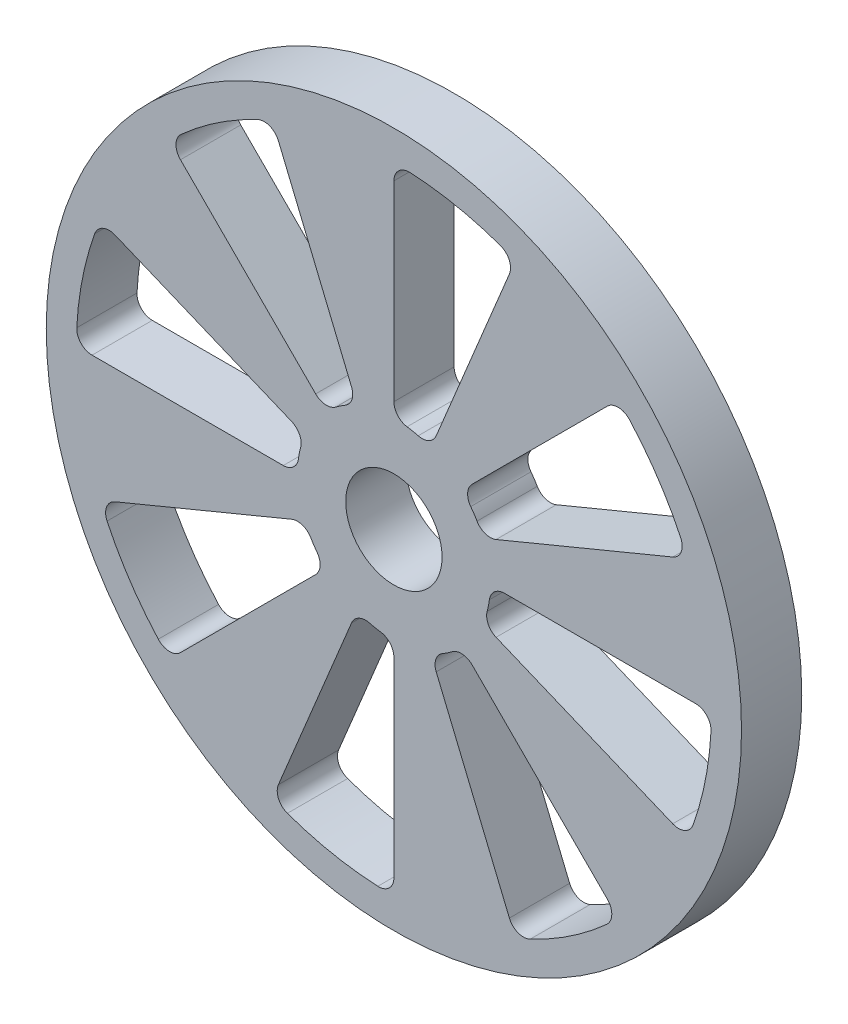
from build123d import *

# Parameters (mm, degrees)
SKETCH1_R           = 28.855
SKETCH1_R_2         = 26.355
SKETCH1_R_3         = 8
SKETCH1_R_4         = 4
BOSS_EXTRUDE1_DEPTH = 5
FILLET2_R           = 1.27


with BuildPart() as part:
    # Sketch1 → Boss-Extrude1 (new body)
    # profile 1 of 10: a face of its own
    with BuildSketch(Plane.XY):
        Circle(SKETCH1_R)
        Circle(SKETCH1_R_2, mode=Mode.SUBTRACT)
    # profile 2 of 10: a face of its own
    with BuildSketch(Plane.XY):
        with BuildLine():
            ThreePointArc((-3.061467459, 7.39103626), (-1.560722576, 7.846282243), (0, 8))
            Line((0, 8), (0, 26.355))
            ThreePointArc((0, 26.355), (-5.141605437, 25.848596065), (-10.08562186, 24.348845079))
            Line((-10.08562186, 24.348845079), (-3.061467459, 7.39103626))
        make_face()
    # profile 3 of 10: a face of its own
    with BuildSketch(Plane.XY):
        with BuildLine():
            Line((10.08562186, 24.348845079), (3.061467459, 7.39103626))
            ThreePointArc((3.061467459, 7.39103626), (4.444561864, 6.651756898), (5.656854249, 5.656854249))
            Line((5.656854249, 5.656854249), (18.635799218, 18.635799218))
            ThreePointArc((18.635799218, 18.635799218), (14.642053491, 21.913381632), (10.08562186, 24.348845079))
        make_face()
    # profile 4 of 10: a face of its own
    with BuildSketch(Plane.XY):
        with BuildLine():
            Line((24.348845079, 10.08562186), (7.39103626, 3.061467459))
            ThreePointArc((7.39103626, 3.061467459), (7.846282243, 1.560722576), (8, 0))
            Line((8, 0), (26.355, 0))
            ThreePointArc((26.355, 0), (25.848596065, 5.141605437), (24.348845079, 10.08562186))
        make_face()
    # profile 5 of 10: a face of its own
    with BuildSketch(Plane.XY):
        with BuildLine():
            Line((24.348845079, -10.08562186), (7.39103626, -3.061467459))
            ThreePointArc((7.39103626, -3.061467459), (6.651756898, -4.444561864), (5.656854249, -5.656854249))
            Line((5.656854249, -5.656854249), (18.635799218, -18.635799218))
            ThreePointArc((18.635799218, -18.635799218), (21.913381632, -14.642053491), (24.348845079, -10.08562186))
        make_face()
    # profile 6 of 10: a face of its own
    with BuildSketch(Plane.XY):
        with BuildLine():
            Line((10.08562186, -24.348845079), (3.061467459, -7.39103626))
            ThreePointArc((3.061467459, -7.39103626), (1.560722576, -7.846282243), (0, -8))
            Line((0, -8), (0, -26.355))
            ThreePointArc((0, -26.355), (5.141605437, -25.848596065), (10.08562186, -24.348845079))
        make_face()
    # profile 7 of 10: a face of its own
    with BuildSketch(Plane.XY):
        with BuildLine():
            ThreePointArc((-3.061467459, -7.39103626), (-4.444561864, -6.651756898), (-5.656854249, -5.656854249))
            Line((-5.656854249, -5.656854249), (-18.635799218, -18.635799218))
            ThreePointArc((-18.635799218, -18.635799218), (-14.642053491, -21.913381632), (-10.08562186, -24.348845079))
            Line((-10.08562186, -24.348845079), (-3.061467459, -7.39103626))
        make_face()
    # profile 8 of 10: a face of its own
    with BuildSketch(Plane.XY):
        with BuildLine():
            ThreePointArc((-7.39103626, -3.061467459), (-7.846282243, -1.560722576), (-8, 0))
            Line((-8, 0), (-26.355, 0))
            ThreePointArc((-26.355, 0), (-25.848596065, -5.141605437), (-24.348845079, -10.08562186))
            Line((-24.348845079, -10.08562186), (-7.39103626, -3.061467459))
        make_face()
    # profile 9 of 10: a face of its own
    with BuildSketch(Plane.XY):
        with BuildLine():
            ThreePointArc((-7.39103626, 3.061467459), (-6.651756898, 4.444561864), (-5.656854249, 5.656854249))
            Line((-5.656854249, 5.656854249), (-18.635799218, 18.635799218))
            ThreePointArc((-18.635799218, 18.635799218), (-21.913381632, 14.642053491), (-24.348845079, 10.08562186))
            Line((-24.348845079, 10.08562186), (-7.39103626, 3.061467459))
        make_face()
    # profile 10 of 10: a face of its own
    with BuildSketch(Plane.XY):
        Circle(SKETCH1_R_3)
        Circle(SKETCH1_R_4, mode=Mode.SUBTRACT)
    extrude(amount=BOSS_EXTRUDE1_DEPTH)

    # Fillet2
    fillet2_edges = [part.edges().sort_by_distance(p)[0] for p in [
        (18.635799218, 18.635799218, 2.5),
        (5.656854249, 5.656854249, 2.5),
        (7.39103626, 3.061467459, 2.5),
        (24.348845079, 10.08562186, 2.5),
        (10.08562186, 24.348845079, 2.5),
        (0, 26.355, 2.5),
        (0, 8, 2.5),
        (3.061467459, 7.39103626, 2.5),
        (-10.08562186, 24.348845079, 2.5),
        (-18.635799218, 18.635799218, 2.5),
        (-5.656854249, 5.656854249, 2.5),
        (-3.061467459, 7.39103626, 2.5),
        (-24.348845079, 10.08562186, 2.5),
        (-26.355, 0, 2.5),
        (-8, 0, 2.5),
        (-7.39103626, 3.061467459, 2.5),
        (-24.348845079, -10.08562186, 2.5),
        (-18.635799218, -18.635799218, 2.5),
        (-5.656854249, -5.656854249, 2.5),
        (-7.39103626, -3.061467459, 2.5),
        (-10.08562186, -24.348845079, 2.5),
        (0, -26.355, 2.5),
        (0, -8, 2.5),
        (-3.061467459, -7.39103626, 2.5),
        (10.08562186, -24.348845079, 2.5),
        (18.635799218, -18.635799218, 2.5),
        (5.656854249, -5.656854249, 2.5),
        (3.061467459, -7.39103626, 2.5),
        (24.348845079, -10.08562186, 2.5),
        (26.355, 0, 2.5),
        (8, 0, 2.5),
        (7.39103626, -3.061467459, 2.5),
    ]]
    fillet(fillet2_edges, radius=FILLET2_R)


solid = part.part
